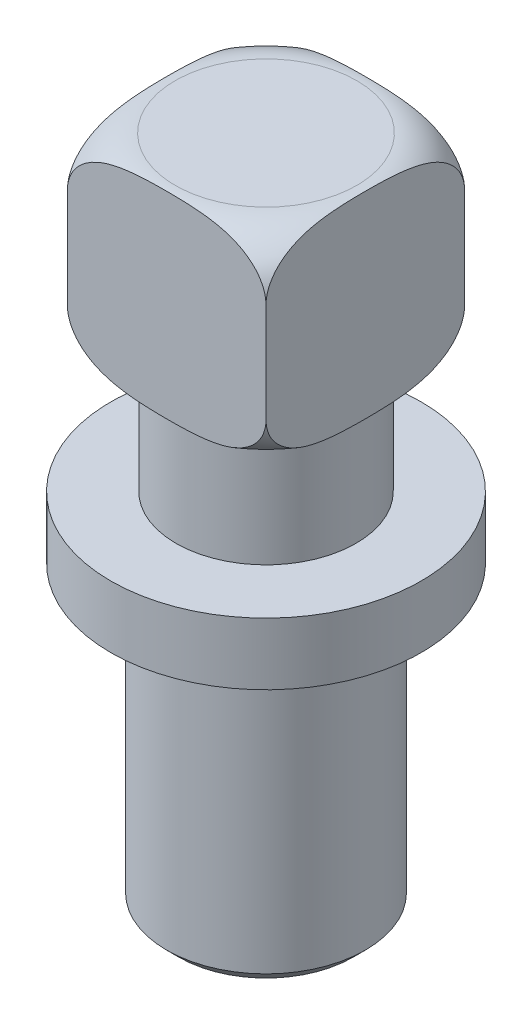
from build123d import *

# Parameters (mm, degrees)
SKETCH1_W      = 16
SKETCH1_H      = 16
EXTRUDE1_DEPTH = 16
CHAMFER1_SIZE  = 1


with BuildPart() as part:
    # Sketch1 → Extrude1 (new body)
    with BuildSketch(Plane(origin=(0, 0, 0), x_dir=(1, 0, 0), z_dir=(0, 1, 0))):
        Rectangle(SKETCH1_W, SKETCH1_H)
    extrude(amount=EXTRUDE1_DEPTH)

    # Sketch2 → Cut-Revolve1 (revolve, cut)
    with BuildSketch(Plane(origin=(0, 0, 0), x_dir=(-0.7071067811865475, 0, 0.7071067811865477), z_dir=(-0.7071067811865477, 0, -0.7071067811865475)), mode=Mode.PRIVATE) as cut_revolve1_sk:
        with BuildLine():
            Line((7.313708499, 16), (7.313708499, 17.605989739))
            Line((7.313708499, 17.605989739), (12.450321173, 17.605989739))
            Line((12.450321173, 17.605989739), (12.450321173, 12))
            Line((12.450321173, 12), (11.313708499, 12))
            ThreePointArc((11.313708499, 12), (10.142135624, 14.828427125), (7.313708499, 16))
        make_face()
        with BuildLine():
            Line((12.450321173, 4), (11.313708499, 4))
            ThreePointArc((11.313708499, 4), (10.142135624, 1.171572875), (7.313708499, 0))
            Line((7.313708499, 0), (7.313708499, -1.605989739))
            Line((7.313708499, -1.605989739), (12.450321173, -1.605989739))
            Line((12.450321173, -1.605989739), (12.450321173, 4))
        make_face()
    revolve(cut_revolve1_sk.sketch.rotate(Axis((0, 0, 0), (0, 1, 0)), 45), axis=Axis((0, 0, 0), (0, 1, 0)), mode=Mode.SUBTRACT)

    # Sketch3 → Revolve1 (revolve)
    with BuildSketch(Plane.XY, mode=Mode.PRIVATE) as revolve1_sk:
        Polygon((0, 0), (7.25, 0), (7.25, -9), (12.5, -9), (12.5, -14), (8, -14), (8, -38), (0, -38), align=None)
    revolve(revolve1_sk.sketch.rotate(Axis((0, 0, 0), (0, -1, 0)), 90), axis=Axis((0, 0, 0), (0, -1, 0)))

    # Chamfer1
    chamfer1_edges = [part.edges().sort_by_distance(p)[0] for p in [
        (0, -38, -8),
    ]]
    chamfer(chamfer1_edges, length=CHAMFER1_SIZE)


solid = part.part
